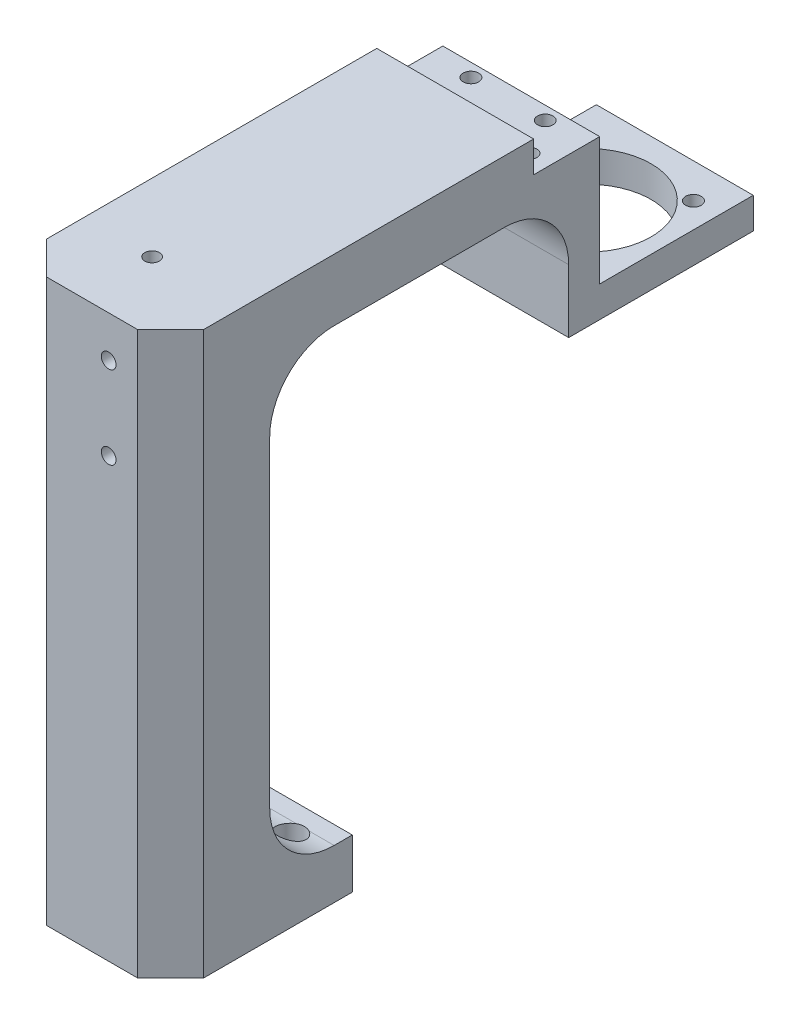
from build123d import *

# Parameters (mm, degrees)
BASE_DEPTH                          = 12.065
BASE_DEPTH_BACK                     = 12.065
CHAMFER1_SIZE                       = 5.08
F_10_32_TAPPED_HOLE1_D              = 4.0386
F_10_32_TAPPED_HOLE1_DEPTH          = 13.6144
F_10_32_TAPPED_HOLE1_TIP            = 1.213317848
F_3_16_0_1875_DIAMETER_HOLE1_D      = 4.7625
F_3_16_0_1875_DIAMETER_HOLE1_DEPTH  = 10.16
SKETCH17_W                          = 24.13
SKETCH17_H                          = 33.7693
EXTRUDE3_DEPTH                      = 4.7625
SKETCH13_R                          = 9.75
EXTRUDE2_DEPTH                      = 24.384
CIRPATTERN1_COUNT                   = 4
F_4_40_TAPPED_HOLE4_D               = 2.2606
F_4_40_TAPPED_HOLE4_DEPTH           = 8.8646
F_4_40_TAPPED_HOLE4_TIP             = 0.679152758
F_3_32_0_09375_DIAMETER_HOLE2_D     = 2.38125
F_3_32_0_09375_DIAMETER_HOLE2_DEPTH = 3.9878
F_3_32_0_09375_DIAMETER_HOLE2_TIP   = 0.715399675
SKETCH34_W                          = 24.13
SKETCH34_H                          = 23.6093
EXTRUDE6_DEPTH                      = 19.6215
F_4_40_TAPPED_HOLE2_D               = 2.2606
F_4_40_TAPPED_HOLE2_DEPTH           = 11.4046
F_4_40_TAPPED_HOLE2_TIP             = 0.679152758
F_4_40_TAPPED_HOLE3_D               = 2.2606
F_4_40_TAPPED_HOLE3_DEPTH           = 11.4046
F_4_40_TAPPED_HOLE3_TIP             = 0.679152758
F_6_32_TAPPED_HOLE1_D               = 2.7051
F_6_32_TAPPED_HOLE1_DEPTH           = 10.9728
F_6_32_TAPPED_HOLE1_TIP             = 0.81269403
F_1_16_0_0625_DIAMETER_HOLE1_D      = 1.5875
F_1_16_0_0625_DIAMETER_HOLE1_DEPTH  = 10.16
F_1_16_0_0625_DIAMETER_HOLE1_TIP    = 0.476933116


with BuildPart() as part:
    # Sketch2 → Base (new, two sides: drawn at the far end of the back side and taken through both)
    with BuildSketch(Plane(origin=(0, 0, 0), x_dir=(0, 0, -1), z_dir=(1, 0, 0)).offset(-BASE_DEPTH_BACK)):
        with BuildLine():
            Line((27.94, 0), (0, 0))
            Line((0, 0), (0, 86.36))
            Line((0, 86.36), (89.5985, 86.36))
            Line((89.5985, 86.36), (89.5985, 57.2135))
            Line((89.5985, 57.2135), (61.214, 57.2135))
            Line((61.214, 57.2135), (61.214, 66.929))
            ThreePointArc((61.214, 66.929), (58.312599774, 73.933599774), (51.308, 76.835))
            Line((51.308, 76.835), (25.146, 76.835))
            ThreePointArc((25.146, 76.835), (18.141400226, 73.933599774), (15.24, 66.929))
            Line((15.24, 66.929), (15.24, 17.526))
            ThreePointArc((15.24, 17.526), (18.141400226, 10.521400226), (25.146, 7.62))
            Line((25.146, 7.62), (27.94, 7.62))
            Line((27.94, 7.62), (27.94, 0))
        make_face()
    extrude(amount=BASE_DEPTH + BASE_DEPTH_BACK)

    # Chamfer1
    chamfer1_edges = [part.edges().sort_by_distance(p)[0] for p in [
        (-12.065, 43.18, 0),
        (12.065, 43.18, 0),
    ]]
    chamfer(chamfer1_edges, length=CHAMFER1_SIZE)

    # 10-32 Tapped Hole1
    with Locations(Plane.XZ):
        with Locations((7.239, -23.368), (-7.239, -5.08)):
            Hole(F_10_32_TAPPED_HOLE1_D / 2, depth=F_10_32_TAPPED_HOLE1_DEPTH)
            with Locations((0, 0, -(F_10_32_TAPPED_HOLE1_DEPTH + F_10_32_TAPPED_HOLE1_TIP / 2))):  # 118° drill point
                Cone(0, F_10_32_TAPPED_HOLE1_D / 2, F_10_32_TAPPED_HOLE1_TIP, mode=Mode.SUBTRACT)

    # 3_16 _0.1875_ Diameter Hole1
    with Locations(Plane.XZ):
        with Locations((7.239, -5.08), (-7.239, -23.368)):
            Hole(F_3_16_0_1875_DIAMETER_HOLE1_D / 2, depth=F_3_16_0_1875_DIAMETER_HOLE1_DEPTH)

    # Sketch17 → Extrude3 (cut)
    with BuildSketch(Plane(origin=(0, 86.36, 0), x_dir=(1, 0, 0), z_dir=(0, 1, 0))):
        with Locations((0, 72.71385)):
            Rectangle(SKETCH17_W, SKETCH17_H)
    extrude(amount=-EXTRUDE3_DEPTH, mode=Mode.SUBTRACT)

    # Sketch13 → Extrude2 (cut)
    with BuildSketch(Plane(origin=(0, 81.5975, 0), x_dir=(1, 0, 0), z_dir=(0, 1, 0))):
        with Locations(Location((0, 76.2, 0), (0, 0, 270))):
            Circle(SKETCH13_R)
    extrude(amount=-EXTRUDE2_DEPTH, mode=Mode.SUBTRACT)

    # Sketch16 → CSK for M2 Flat Head Machine Screw1 (revolve, cut)
    with BuildSketch(Plane(origin=(8.067115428, 57.2135, -68.004168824), x_dir=(0, 0, -1), z_dir=(1, 0, 0))):
        Polygon((0, 0), (0, 24.384), (1.2, 24.384), (1.2, 1.50038), (2.2, 0.50038), (2.2, 0), align=None)
    csk_for_m2_flat_head_machine_screw1 = revolve(axis=Axis((8.067115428, 50.8635, -68.004168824), (0, 1, 0)), mode=Mode.SUBTRACT)

    # CirPattern1: CSK for M2 Flat Head Machine Screw1 ×4 about axis
    cirpattern1_axis = Axis((0, 0, -76.2), (0, 1, 0))
    for i in range(1, CIRPATTERN1_COUNT):
        add(csk_for_m2_flat_head_machine_screw1.rotate(cirpattern1_axis, i * 360 / CIRPATTERN1_COUNT), mode=Mode.SUBTRACT)

    # 4-40 Tapped Hole4
    with Locations(Plane(origin=(0, 81.5975, 0), x_dir=(-1, 0, 0), z_dir=(0, 1, 0))):
        with Locations((-8.89, -58.3692), (8.89, -58.3692)):
            Hole(F_4_40_TAPPED_HOLE4_D / 2, depth=F_4_40_TAPPED_HOLE4_DEPTH)
            with Locations((0, 0, -(F_4_40_TAPPED_HOLE4_DEPTH + F_4_40_TAPPED_HOLE4_TIP / 2))):  # 118° drill point
                Cone(0, F_4_40_TAPPED_HOLE4_D / 2, F_4_40_TAPPED_HOLE4_TIP, mode=Mode.SUBTRACT)

    # 3_32 _0.09375_ Diameter Hole2
    with Locations(Plane(origin=(0, 81.5975, 0), x_dir=(-1, 0, 0), z_dir=(0, 1, 0))):
        with Locations((5.715, -63.9572), (-5.715, -63.9572)):
            Hole(F_3_32_0_09375_DIAMETER_HOLE2_D / 2, depth=F_3_32_0_09375_DIAMETER_HOLE2_DEPTH)
            with Locations((0, 0, -(F_3_32_0_09375_DIAMETER_HOLE2_DEPTH + F_3_32_0_09375_DIAMETER_HOLE2_TIP / 2))):  # 118° drill point
                Cone(0, F_3_32_0_09375_DIAMETER_HOLE2_D / 2, F_3_32_0_09375_DIAMETER_HOLE2_TIP, mode=Mode.SUBTRACT)

    # Sketch34 → Extrude6 (cut)
    with BuildSketch(Plane(origin=(0, 81.5975, 0), x_dir=(1, 0, 0), z_dir=(0, 1, 0))):
        with Locations((0, 77.79385)):
            Rectangle(SKETCH34_W, SKETCH34_H)
    extrude(amount=-EXTRUDE6_DEPTH, mode=Mode.SUBTRACT)

    # 4-40 Tapped Hole2
    with Locations(Plane(origin=(-1.5748, 86.36, -10.795), x_dir=(0, 0, 1), z_dir=(0, 1, 0))):
        with Locations((0, 0)):
            Hole(F_4_40_TAPPED_HOLE2_D / 2, depth=F_4_40_TAPPED_HOLE2_DEPTH)
            with Locations((0, 0, -(F_4_40_TAPPED_HOLE2_DEPTH + F_4_40_TAPPED_HOLE2_TIP / 2))):  # 118° drill point
                Cone(0, F_4_40_TAPPED_HOLE2_D / 2, F_4_40_TAPPED_HOLE2_TIP, mode=Mode.SUBTRACT)

    # 4-40 Tapped Hole3
    with Locations(Plane.XY):
        with Locations((2.54, 67.31), (2.54, 80.01)):
            Hole(F_4_40_TAPPED_HOLE3_D / 2, depth=F_4_40_TAPPED_HOLE3_DEPTH)
            with Locations((0, 0, -(F_4_40_TAPPED_HOLE3_DEPTH + F_4_40_TAPPED_HOLE3_TIP / 2))):  # 118° drill point
                Cone(0, F_4_40_TAPPED_HOLE3_D / 2, F_4_40_TAPPED_HOLE3_TIP, mode=Mode.SUBTRACT)

    # 6-32 Tapped Hole1
    with Locations(Plane(origin=(-12.065, 81.5975, -44.158760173), x_dir=(0, 0, -1), z_dir=(-1, 0, 0))):
        with Locations((0, 0)):
            Hole(F_6_32_TAPPED_HOLE1_D / 2, depth=F_6_32_TAPPED_HOLE1_DEPTH)
            with Locations((0, 0, -(F_6_32_TAPPED_HOLE1_DEPTH + F_6_32_TAPPED_HOLE1_TIP / 2))):  # 118° drill point
                Cone(0, F_6_32_TAPPED_HOLE1_D / 2, F_6_32_TAPPED_HOLE1_TIP, mode=Mode.SUBTRACT)

    # 1_16 _0.0625_ Diameter Hole1
    with Locations(Plane(origin=(-12.065, 81.5975, -39.040882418), x_dir=(0, 0, -1), z_dir=(-1, 0, 0))):
        with Locations((0, 0)):
            Hole(F_1_16_0_0625_DIAMETER_HOLE1_D / 2, depth=F_1_16_0_0625_DIAMETER_HOLE1_DEPTH)
            with Locations((0, 0, -(F_1_16_0_0625_DIAMETER_HOLE1_DEPTH + F_1_16_0_0625_DIAMETER_HOLE1_TIP / 2))):  # 118° drill point
                Cone(0, F_1_16_0_0625_DIAMETER_HOLE1_D / 2, F_1_16_0_0625_DIAMETER_HOLE1_TIP, mode=Mode.SUBTRACT)


solid = part.part
